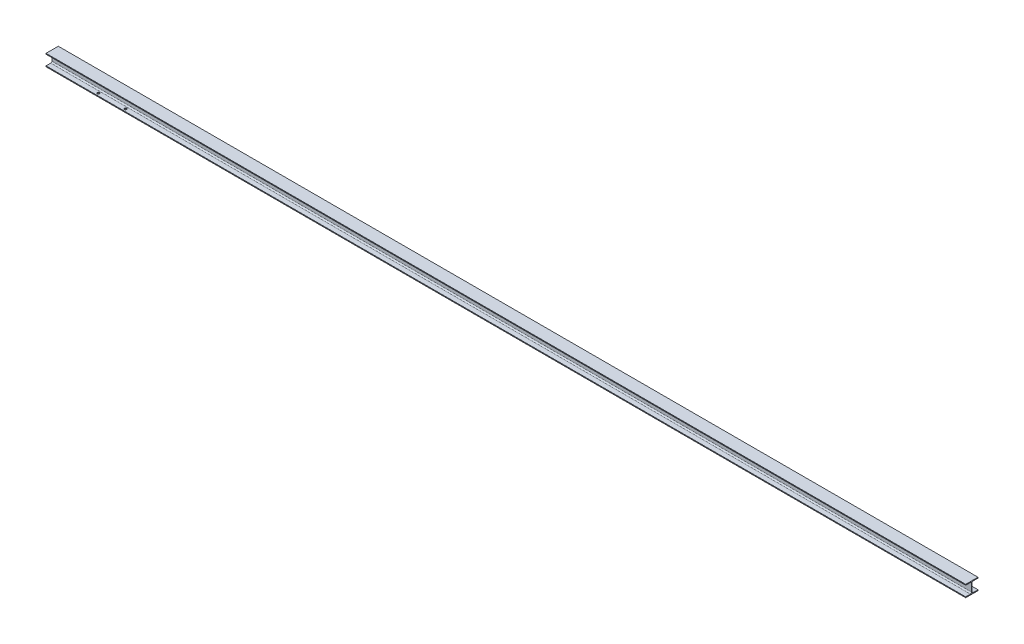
ISO-10303-21;
HEADER;
FILE_DESCRIPTION(('STEP AP214'),'2;1');
FILE_NAME('part.step','',(''),(''),'','','');
FILE_SCHEMA(('AUTOMOTIVE_DESIGN { 1 0 10303 214 1 1 1 1 }'));
ENDSEC;
DATA;
#1=APPLICATION_CONTEXT('core data for automotive mechanical design processes');
#2=APPLICATION_PROTOCOL_DEFINITION('international standard','automotive_design',2000,#1);
#3=PRODUCT_CONTEXT('',#1,'mechanical');
#4=PRODUCT('Part','Part','',(#3));
#5=PRODUCT_RELATED_PRODUCT_CATEGORY('part','',(#4));
#6=PRODUCT_DEFINITION_FORMATION('','',#4);
#7=PRODUCT_DEFINITION_CONTEXT('part definition',#1,'design');
#8=PRODUCT_DEFINITION('design','',#6,#7);
#9=PRODUCT_DEFINITION_SHAPE('','',#8);
#10=(LENGTH_UNIT() NAMED_UNIT(*) SI_UNIT(.MILLI.,.METRE.));
#11=(NAMED_UNIT(*) PLANE_ANGLE_UNIT() SI_UNIT($,.RADIAN.));
#12=(NAMED_UNIT(*) SI_UNIT($,.STERADIAN.) SOLID_ANGLE_UNIT());
#13=UNCERTAINTY_MEASURE_WITH_UNIT(LENGTH_MEASURE(1.E-05),#10,'distance_accuracy_value','');
#14=(GEOMETRIC_REPRESENTATION_CONTEXT(3) GLOBAL_UNCERTAINTY_ASSIGNED_CONTEXT((#13)) GLOBAL_UNIT_ASSIGNED_CONTEXT((#10,
#11,#12)) REPRESENTATION_CONTEXT('',''));
#15=CARTESIAN_POINT('',(0.,0.,0.));
#16=DIRECTION('',(0.,0.,1.));
#17=DIRECTION('',(1.,0.,0.));
#18=AXIS2_PLACEMENT_3D('',#15,#16,#17);
#19=CARTESIAN_POINT('',(9149.96897120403,37.0000000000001,-14.4999999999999));
#20=DIRECTION('',(-1.,0.,0.));
#21=DIRECTION('',(0.,-1.,0.));
#22=AXIS2_PLACEMENT_3D('',#19,#20,#21);
#23=PLANE('',#22);
#24=DIRECTION('',(0.,-1.,0.));
#25=VECTOR('',#24,1.);
#26=CARTESIAN_POINT('',(9149.96897120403,48.9999999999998,60.0000000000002));
#27=LINE('',#26,#25);
#28=CARTESIAN_POINT('',(9149.96897120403,56.9999999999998,60.0000000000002));
#29=VERTEX_POINT('',#28);
#30=CARTESIAN_POINT('',(9149.96897120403,48.9999999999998,60.0000000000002));
#31=VERTEX_POINT('',#30);
#32=EDGE_CURVE('E146',#29,#31,#27,.T.);
#33=ORIENTED_EDGE('',*,*,#32,.T.);
#34=DIRECTION('',(0.,0.,-1.));
#35=VECTOR('',#34,1.);
#36=CARTESIAN_POINT('',(9149.96897120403,49.,14.5000000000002));
#37=LINE('',#36,#35);
#38=CARTESIAN_POINT('',(9149.96897120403,49.,14.5000000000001));
#39=VERTEX_POINT('',#38);
#40=EDGE_CURVE('E142',#31,#39,#37,.T.);
#41=ORIENTED_EDGE('',*,*,#40,.T.);
#42=CARTESIAN_POINT('',(9149.96897120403,37.,14.5000000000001));
#43=DIRECTION('',(-1.,0.,0.));
#44=DIRECTION('',(0.,1.,0.));
#45=AXIS2_PLACEMENT_3D('',#42,#43,#44);
#46=CIRCLE('',#45,12.);
#47=CARTESIAN_POINT('',(9149.96897120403,37.,2.50000000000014));
#48=VERTEX_POINT('',#47);
#49=EDGE_CURVE('E160',#39,#48,#46,.T.);
#50=ORIENTED_EDGE('',*,*,#49,.T.);
#51=DIRECTION('',(0.,-1.,0.));
#52=VECTOR('',#51,1.);
#53=CARTESIAN_POINT('',(9149.96897120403,-37.,2.49999999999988));
#54=LINE('',#53,#52);
#55=CARTESIAN_POINT('',(9149.96897120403,-37.,2.49999999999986));
#56=VERTEX_POINT('',#55);
#57=EDGE_CURVE('E281',#48,#56,#54,.T.);
#58=ORIENTED_EDGE('',*,*,#57,.T.);
#59=CARTESIAN_POINT('',(9149.96897120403,-37.,14.4999999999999));
#60=DIRECTION('',(-1.,0.,0.));
#61=DIRECTION('',(0.,-1.,0.));
#62=AXIS2_PLACEMENT_3D('',#59,#60,#61);
#63=CIRCLE('',#62,12.);
#64=CARTESIAN_POINT('',(9149.96897120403,-49.,14.4999999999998));
#65=VERTEX_POINT('',#64);
#66=EDGE_CURVE('E279',#56,#65,#63,.T.);
#67=ORIENTED_EDGE('',*,*,#66,.T.);
#68=DIRECTION('',(0.,0.,1.));
#69=VECTOR('',#68,1.);
#70=CARTESIAN_POINT('',(9149.96897120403,-49.,14.4999999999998));
#71=LINE('',#70,#69);
#72=CARTESIAN_POINT('',(9149.96897120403,-49.0000000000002,59.9999999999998));
#73=VERTEX_POINT('',#72);
#74=EDGE_CURVE('E277',#65,#73,#71,.T.);
#75=ORIENTED_EDGE('',*,*,#74,.T.);
#76=DIRECTION('',(0.,-1.,0.));
#77=VECTOR('',#76,1.);
#78=CARTESIAN_POINT('',(9149.96897120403,-57.0000000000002,59.9999999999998));
#79=LINE('',#78,#77);
#80=CARTESIAN_POINT('',(9149.96897120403,-57.0000000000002,59.9999999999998));
#81=VERTEX_POINT('',#80);
#82=EDGE_CURVE('E275',#73,#81,#79,.T.);
#83=ORIENTED_EDGE('',*,*,#82,.T.);
#84=DIRECTION('',(0.,0.,-1.));
#85=VECTOR('',#84,1.);
#86=CARTESIAN_POINT('',(9149.96897120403,-56.9999999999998,-60.0000000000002));
#87=LINE('',#86,#85);
#88=CARTESIAN_POINT('',(9149.96897120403,-56.9999999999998,-60.0000000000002));
#89=VERTEX_POINT('',#88);
#90=EDGE_CURVE('E273',#81,#89,#87,.T.);
#91=ORIENTED_EDGE('',*,*,#90,.T.);
#92=DIRECTION('',(0.,1.,0.));
#93=VECTOR('',#92,1.);
#94=CARTESIAN_POINT('',(9149.96897120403,-56.9999999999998,-60.0000000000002));
#95=LINE('',#94,#93);
#96=CARTESIAN_POINT('',(9149.96897120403,-48.9999999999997,-60.0000000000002));
#97=VERTEX_POINT('',#96);
#98=EDGE_CURVE('E271',#89,#97,#95,.T.);
#99=ORIENTED_EDGE('',*,*,#98,.T.);
#100=DIRECTION('',(0.,0.,1.));
#101=VECTOR('',#100,1.);
#102=CARTESIAN_POINT('',(9149.96897120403,-48.9999999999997,-60.0000000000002));
#103=LINE('',#102,#101);
#104=CARTESIAN_POINT('',(9149.96897120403,-48.9999999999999,-14.5000000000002));
#105=VERTEX_POINT('',#104);
#106=EDGE_CURVE('E269',#97,#105,#103,.T.);
#107=ORIENTED_EDGE('',*,*,#106,.T.);
#108=CARTESIAN_POINT('',(9149.96897120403,-36.9999999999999,-14.5000000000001));
#109=DIRECTION('',(-1.,0.,0.));
#110=DIRECTION('',(0.,1.,0.));
#111=AXIS2_PLACEMENT_3D('',#108,#109,#110);
#112=CIRCLE('',#111,12.);
#113=CARTESIAN_POINT('',(9149.96897120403,-36.9999999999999,-2.50000000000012));
#114=VERTEX_POINT('',#113);
#115=EDGE_CURVE('E267',#105,#114,#112,.T.);
#116=ORIENTED_EDGE('',*,*,#115,.T.);
#117=DIRECTION('',(0.,1.,0.));
#118=VECTOR('',#117,1.);
#119=CARTESIAN_POINT('',(9149.96897120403,-36.9999999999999,-2.50000000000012));
#120=LINE('',#119,#118);
#121=CARTESIAN_POINT('',(9149.96897120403,37.0000000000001,-2.49999999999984));
#122=VERTEX_POINT('',#121);
#123=EDGE_CURVE('E265',#114,#122,#120,.T.);
#124=ORIENTED_EDGE('',*,*,#123,.T.);
#125=CARTESIAN_POINT('',(9149.96897120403,37.0000000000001,-14.4999999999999));
#126=DIRECTION('',(-1.,0.,0.));
#127=DIRECTION('',(0.,-1.,0.));
#128=AXIS2_PLACEMENT_3D('',#125,#126,#127);
#129=CIRCLE('',#128,12.);
#130=CARTESIAN_POINT('',(9149.96897120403,49.0000000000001,-14.4999999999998));
#131=VERTEX_POINT('',#130);
#132=EDGE_CURVE('E263',#122,#131,#129,.T.);
#133=ORIENTED_EDGE('',*,*,#132,.T.);
#134=DIRECTION('',(0.,0.,-1.));
#135=VECTOR('',#134,1.);
#136=CARTESIAN_POINT('',(9149.96897120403,49.0000000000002,-59.9999999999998));
#137=LINE('',#136,#135);
#138=CARTESIAN_POINT('',(9149.96897120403,49.0000000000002,-59.9999999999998));
#139=VERTEX_POINT('',#138);
#140=EDGE_CURVE('E261',#131,#139,#137,.T.);
#141=ORIENTED_EDGE('',*,*,#140,.T.);
#142=DIRECTION('',(0.,1.,0.));
#143=VECTOR('',#142,1.);
#144=CARTESIAN_POINT('',(9149.96897120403,49.0000000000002,-59.9999999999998));
#145=LINE('',#144,#143);
#146=CARTESIAN_POINT('',(9149.96897120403,57.0000000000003,-59.9999999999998));
#147=VERTEX_POINT('',#146);
#148=EDGE_CURVE('E259',#139,#147,#145,.T.);
#149=ORIENTED_EDGE('',*,*,#148,.T.);
#150=DIRECTION('',(0.,0.,1.));
#151=VECTOR('',#150,1.);
#152=CARTESIAN_POINT('',(9149.96897120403,57.0000000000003,-59.9999999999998));
#153=LINE('',#152,#151);
#154=EDGE_CURVE('E147',#147,#29,#153,.T.);
#155=ORIENTED_EDGE('',*,*,#154,.T.);
#156=EDGE_LOOP('',(#33,#41,#50,#58,#67,#75,#83,#91,#99,#107,#116,#124,#133,#141,#149,#155));
#157=FACE_BOUND('',#156,.T.);
#158=ADVANCED_FACE('F34',(#157),#23,.F.);
#159=CARTESIAN_POINT('',(169.999999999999,1900.,-147.000000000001));
#160=DIRECTION('',(-1.,0.,0.));
#161=DIRECTION('',(0.,0.,1.));
#162=AXIS2_PLACEMENT_3D('',#159,#160,#161);
#163=PLANE('',#162);
#164=DIRECTION('',(0.,1.,0.));
#165=VECTOR('',#164,1.);
#166=CARTESIAN_POINT('',(170.,48.9999999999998,60.0000000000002));
#167=LINE('',#166,#165);
#168=CARTESIAN_POINT('',(170.,48.9999999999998,60.0000000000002));
#169=VERTEX_POINT('',#168);
#170=CARTESIAN_POINT('',(170.,56.9999999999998,60.0000000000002));
#171=VERTEX_POINT('',#170);
#172=EDGE_CURVE('E165',#169,#171,#167,.T.);
#173=ORIENTED_EDGE('',*,*,#172,.T.);
#174=DIRECTION('',(0.,0.,-1.));
#175=VECTOR('',#174,1.);
#176=CARTESIAN_POINT('',(170.,57.0000000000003,-59.9999999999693));
#177=LINE('',#176,#175);
#178=CARTESIAN_POINT('',(170.,57.0000000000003,-59.9999999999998));
#179=VERTEX_POINT('',#178);
#180=EDGE_CURVE('E219',#171,#179,#177,.T.);
#181=ORIENTED_EDGE('',*,*,#180,.T.);
#182=DIRECTION('',(0.,-1.,0.));
#183=VECTOR('',#182,1.);
#184=CARTESIAN_POINT('',(170.,49.0000000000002,-59.9999999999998));
#185=LINE('',#184,#183);
#186=CARTESIAN_POINT('',(170.,49.0000000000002,-59.9999999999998));
#187=VERTEX_POINT('',#186);
#188=EDGE_CURVE('E215',#179,#187,#185,.T.);
#189=ORIENTED_EDGE('',*,*,#188,.T.);
#190=DIRECTION('',(0.,0.,1.));
#191=VECTOR('',#190,1.);
#192=CARTESIAN_POINT('',(170.,49.0000000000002,-59.9999999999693));
#193=LINE('',#192,#191);
#194=CARTESIAN_POINT('',(170.,49.0000000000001,-14.4999999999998));
#195=VERTEX_POINT('',#194);
#196=EDGE_CURVE('E218',#187,#195,#193,.T.);
#197=ORIENTED_EDGE('',*,*,#196,.T.);
#198=CARTESIAN_POINT('',(170.,37.0000000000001,-14.4999999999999));
#199=DIRECTION('',(-1.,0.,0.));
#200=DIRECTION('',(0.,0.,1.));
#201=AXIS2_PLACEMENT_3D('',#198,#199,#200);
#202=CIRCLE('',#201,12.);
#203=CARTESIAN_POINT('',(170.,37.0000000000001,-2.49999999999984));
#204=VERTEX_POINT('',#203);
#205=EDGE_CURVE('E222',#195,#204,#202,.F.);
#206=ORIENTED_EDGE('',*,*,#205,.T.);
#207=DIRECTION('',(0.,-1.,0.));
#208=VECTOR('',#207,1.);
#209=CARTESIAN_POINT('',(170.,-36.9999999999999,-2.50000000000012));
#210=LINE('',#209,#208);
#211=CARTESIAN_POINT('',(170.,-36.9999999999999,-2.50000000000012));
#212=VERTEX_POINT('',#211);
#213=EDGE_CURVE('E225',#204,#212,#210,.T.);
#214=ORIENTED_EDGE('',*,*,#213,.T.);
#215=CARTESIAN_POINT('',(170.,-36.9999999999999,-14.5000000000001));
#216=DIRECTION('',(-1.,0.,0.));
#217=DIRECTION('',(0.,0.,1.));
#218=AXIS2_PLACEMENT_3D('',#215,#216,#217);
#219=CIRCLE('',#218,12.);
#220=CARTESIAN_POINT('',(170.,-48.9999999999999,-14.5000000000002));
#221=VERTEX_POINT('',#220);
#222=EDGE_CURVE('E228',#212,#221,#219,.F.);
#223=ORIENTED_EDGE('',*,*,#222,.T.);
#224=DIRECTION('',(0.,0.,-1.));
#225=VECTOR('',#224,1.);
#226=CARTESIAN_POINT('',(170.,-48.9999999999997,-59.9999999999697));
#227=LINE('',#226,#225);
#228=CARTESIAN_POINT('',(170.,-48.9999999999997,-60.0000000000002));
#229=VERTEX_POINT('',#228);
#230=EDGE_CURVE('E231',#221,#229,#227,.T.);
#231=ORIENTED_EDGE('',*,*,#230,.T.);
#232=DIRECTION('',(0.,-1.,0.));
#233=VECTOR('',#232,1.);
#234=CARTESIAN_POINT('',(170.,-56.9999999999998,-60.0000000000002));
#235=LINE('',#234,#233);
#236=CARTESIAN_POINT('',(170.,-56.9999999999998,-60.0000000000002));
#237=VERTEX_POINT('',#236);
#238=EDGE_CURVE('E234',#229,#237,#235,.T.);
#239=ORIENTED_EDGE('',*,*,#238,.T.);
#240=DIRECTION('',(0.,0.,1.));
#241=VECTOR('',#240,1.);
#242=CARTESIAN_POINT('',(170.,-56.9999999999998,-59.9999999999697));
#243=LINE('',#242,#241);
#244=CARTESIAN_POINT('',(170.,-57.0000000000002,59.9999999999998));
#245=VERTEX_POINT('',#244);
#246=EDGE_CURVE('E237',#237,#245,#243,.T.);
#247=ORIENTED_EDGE('',*,*,#246,.T.);
#248=DIRECTION('',(0.,1.,0.));
#249=VECTOR('',#248,1.);
#250=CARTESIAN_POINT('',(170.,-57.0000000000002,59.9999999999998));
#251=LINE('',#250,#249);
#252=CARTESIAN_POINT('',(170.,-49.0000000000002,59.9999999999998));
#253=VERTEX_POINT('',#252);
#254=EDGE_CURVE('E240',#245,#253,#251,.T.);
#255=ORIENTED_EDGE('',*,*,#254,.T.);
#256=DIRECTION('',(0.,0.,-1.));
#257=VECTOR('',#256,1.);
#258=CARTESIAN_POINT('',(170.,-49.,14.5000000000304));
#259=LINE('',#258,#257);
#260=CARTESIAN_POINT('',(170.,-49.,14.4999999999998));
#261=VERTEX_POINT('',#260);
#262=EDGE_CURVE('E243',#253,#261,#259,.T.);
#263=ORIENTED_EDGE('',*,*,#262,.T.);
#264=CARTESIAN_POINT('',(170.,-37.,14.4999999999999));
#265=DIRECTION('',(-1.,0.,0.));
#266=DIRECTION('',(0.,0.,1.));
#267=AXIS2_PLACEMENT_3D('',#264,#265,#266);
#268=CIRCLE('',#267,12.);
#269=CARTESIAN_POINT('',(170.,-37.,2.49999999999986));
#270=VERTEX_POINT('',#269);
#271=EDGE_CURVE('E246',#261,#270,#268,.F.);
#272=ORIENTED_EDGE('',*,*,#271,.T.);
#273=DIRECTION('',(0.,1.,0.));
#274=VECTOR('',#273,1.);
#275=CARTESIAN_POINT('',(170.,-37.,2.49999999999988));
#276=LINE('',#275,#274);
#277=CARTESIAN_POINT('',(170.,37.,2.50000000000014));
#278=VERTEX_POINT('',#277);
#279=EDGE_CURVE('E249',#270,#278,#276,.T.);
#280=ORIENTED_EDGE('',*,*,#279,.T.);
#281=CARTESIAN_POINT('',(170.,37.,14.5000000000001));
#282=DIRECTION('',(-1.,0.,0.));
#283=DIRECTION('',(0.,0.,1.));
#284=AXIS2_PLACEMENT_3D('',#281,#282,#283);
#285=CIRCLE('',#284,12.);
#286=CARTESIAN_POINT('',(170.,49.,14.5000000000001));
#287=VERTEX_POINT('',#286);
#288=EDGE_CURVE('E252',#278,#287,#285,.F.);
#289=ORIENTED_EDGE('',*,*,#288,.T.);
#290=DIRECTION('',(0.,0.,1.));
#291=VECTOR('',#290,1.);
#292=CARTESIAN_POINT('',(170.,49.,14.5000000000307));
#293=LINE('',#292,#291);
#294=EDGE_CURVE('E170',#287,#169,#293,.T.);
#295=ORIENTED_EDGE('',*,*,#294,.T.);
#296=EDGE_LOOP('',(#173,#181,#189,#197,#206,#214,#223,#231,#239,#247,#255,#263,#272,#280,#289,#295));
#297=FACE_BOUND('',#296,.T.);
#298=ADVANCED_FACE('F348',(#297),#163,.T.);
#299=CARTESIAN_POINT('',(9149.96897120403,48.9999999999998,60.0000000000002));
#300=DIRECTION('',(0.,0.,-1.));
#301=DIRECTION('',(0.,1.,0.));
#302=AXIS2_PLACEMENT_3D('',#299,#300,#301);
#303=PLANE('',#302);
#304=DIRECTION('',(-1.,0.,0.));
#305=VECTOR('',#304,1.);
#306=CARTESIAN_POINT('',(9149.96897120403,48.9999999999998,60.0000000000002));
#307=LINE('',#306,#305);
#308=EDGE_CURVE('E156',#31,#169,#307,.T.);
#309=ORIENTED_EDGE('',*,*,#308,.F.);
#310=ORIENTED_EDGE('',*,*,#32,.F.);
#311=DIRECTION('',(-1.,0.,0.));
#312=VECTOR('',#311,1.);
#313=CARTESIAN_POINT('',(9149.96897120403,56.9999999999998,60.0000000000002));
#314=LINE('',#313,#312);
#315=EDGE_CURVE('E166',#29,#171,#314,.T.);
#316=ORIENTED_EDGE('',*,*,#315,.T.);
#317=ORIENTED_EDGE('',*,*,#172,.F.);
#318=EDGE_LOOP('',(#309,#310,#316,#317));
#319=FACE_BOUND('',#318,.T.);
#320=ADVANCED_FACE('F163',(#319),#303,.F.);
#321=CARTESIAN_POINT('',(9149.96897120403,49.,14.5000000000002));
#322=DIRECTION('',(0.,1.,0.));
#323=DIRECTION('',(0.,0.,1.));
#324=AXIS2_PLACEMENT_3D('',#321,#322,#323);
#325=PLANE('',#324);
#326=DIRECTION('',(-1.,0.,0.));
#327=VECTOR('',#326,1.);
#328=CARTESIAN_POINT('',(9149.96897120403,49.,14.5000000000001));
#329=LINE('',#328,#327);
#330=EDGE_CURVE('E158',#39,#287,#329,.T.);
#331=ORIENTED_EDGE('',*,*,#330,.F.);
#332=ORIENTED_EDGE('',*,*,#40,.F.);
#333=ORIENTED_EDGE('',*,*,#308,.T.);
#334=ORIENTED_EDGE('',*,*,#294,.F.);
#335=EDGE_LOOP('',(#331,#332,#333,#334));
#336=FACE_BOUND('',#335,.T.);
#337=ADVANCED_FACE('F154',(#336),#325,.F.);
#338=CARTESIAN_POINT('',(9149.96897120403,37.,14.5000000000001));
#339=DIRECTION('',(-1.,0.,0.));
#340=DIRECTION('',(0.,0.,1.));
#341=AXIS2_PLACEMENT_3D('',#338,#339,#340);
#342=CYLINDRICAL_SURFACE('',#341,12.);
#343=DIRECTION('',(-1.,0.,0.));
#344=VECTOR('',#343,1.);
#345=CARTESIAN_POINT('',(9149.96897120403,37.,2.50000000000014));
#346=LINE('',#345,#344);
#347=EDGE_CURVE('E168',#48,#278,#346,.T.);
#348=ORIENTED_EDGE('',*,*,#347,.F.);
#349=ORIENTED_EDGE('',*,*,#49,.F.);
#350=ORIENTED_EDGE('',*,*,#330,.T.);
#351=ORIENTED_EDGE('',*,*,#288,.F.);
#352=EDGE_LOOP('',(#348,#349,#350,#351));
#353=FACE_BOUND('',#352,.T.);
#354=ADVANCED_FACE('F288',(#353),#342,.F.);
#355=CARTESIAN_POINT('',(9149.96897120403,-37.,2.49999999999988));
#356=DIRECTION('',(0.,0.,-1.));
#357=DIRECTION('',(0.,1.,0.));
#358=AXIS2_PLACEMENT_3D('',#355,#356,#357);
#359=PLANE('',#358);
#360=DIRECTION('',(-1.,0.,0.));
#361=VECTOR('',#360,1.);
#362=CARTESIAN_POINT('',(9149.96897120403,-37.,2.49999999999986));
#363=LINE('',#362,#361);
#364=EDGE_CURVE('E174',#56,#270,#363,.T.);
#365=ORIENTED_EDGE('',*,*,#364,.F.);
#366=ORIENTED_EDGE('',*,*,#57,.F.);
#367=ORIENTED_EDGE('',*,*,#347,.T.);
#368=ORIENTED_EDGE('',*,*,#279,.F.);
#369=EDGE_LOOP('',(#365,#366,#367,#368));
#370=FACE_BOUND('',#369,.T.);
#371=ADVANCED_FACE('F291',(#370),#359,.F.);
#372=CARTESIAN_POINT('',(9149.96897120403,-37.,14.4999999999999));
#373=DIRECTION('',(-1.,0.,0.));
#374=DIRECTION('',(0.,0.,1.));
#375=AXIS2_PLACEMENT_3D('',#372,#373,#374);
#376=CYLINDRICAL_SURFACE('',#375,12.);
#377=DIRECTION('',(-1.,0.,0.));
#378=VECTOR('',#377,1.);
#379=CARTESIAN_POINT('',(9149.96897120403,-49.,14.4999999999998));
#380=LINE('',#379,#378);
#381=EDGE_CURVE('E176',#65,#261,#380,.T.);
#382=ORIENTED_EDGE('',*,*,#381,.F.);
#383=ORIENTED_EDGE('',*,*,#66,.F.);
#384=ORIENTED_EDGE('',*,*,#364,.T.);
#385=ORIENTED_EDGE('',*,*,#271,.F.);
#386=EDGE_LOOP('',(#382,#383,#384,#385));
#387=FACE_BOUND('',#386,.T.);
#388=ADVANCED_FACE('F296',(#387),#376,.F.);
#389=CARTESIAN_POINT('',(9149.96897120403,-49.,14.4999999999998));
#390=DIRECTION('',(0.,-1.,0.));
#391=DIRECTION('',(0.,0.,-1.));
#392=AXIS2_PLACEMENT_3D('',#389,#390,#391);
#393=PLANE('',#392);
#394=CARTESIAN_POINT('',(922.786796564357,-49.0000000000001,34.9999999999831));
#395=DIRECTION('',(0.,-1.,0.));
#396=DIRECTION('',(0.,0.,-1.));
#397=AXIS2_PLACEMENT_3D('',#394,#395,#396);
#398=CIRCLE('',#397,11.);
#399=CARTESIAN_POINT('',(922.786796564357,-49.,23.9999999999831));
#400=VERTEX_POINT('',#399);
#401=EDGE_CURVE('E151',#400,#400,#398,.T.);
#402=ORIENTED_EDGE('',*,*,#401,.T.);
#403=EDGE_LOOP('',(#402));
#404=FACE_BOUND('',#403,.T.);
#405=CARTESIAN_POINT('',(656.786796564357,-49.0000000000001,34.9999999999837));
#406=DIRECTION('',(0.,-1.,0.));
#407=DIRECTION('',(0.,0.,-1.));
#408=AXIS2_PLACEMENT_3D('',#405,#406,#407);
#409=CIRCLE('',#408,11.);
#410=CARTESIAN_POINT('',(656.786796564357,-49.,23.9999999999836));
#411=VERTEX_POINT('',#410);
#412=EDGE_CURVE('E200',#411,#411,#409,.T.);
#413=ORIENTED_EDGE('',*,*,#412,.T.);
#414=EDGE_LOOP('',(#413));
#415=FACE_BOUND('',#414,.T.);
#416=DIRECTION('',(-1.,0.,0.));
#417=VECTOR('',#416,1.);
#418=CARTESIAN_POINT('',(9149.96897120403,-49.0000000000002,59.9999999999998));
#419=LINE('',#418,#417);
#420=EDGE_CURVE('E178',#73,#253,#419,.T.);
#421=ORIENTED_EDGE('',*,*,#420,.F.);
#422=ORIENTED_EDGE('',*,*,#74,.F.);
#423=ORIENTED_EDGE('',*,*,#381,.T.);
#424=ORIENTED_EDGE('',*,*,#262,.F.);
#425=EDGE_LOOP('',(#421,#422,#423,#424));
#426=FACE_BOUND('',#425,.T.);
#427=ADVANCED_FACE('F303',(#404,#415,#426),#393,.F.);
#428=CARTESIAN_POINT('',(9149.96897120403,-57.0000000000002,59.9999999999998));
#429=DIRECTION('',(0.,0.,-1.));
#430=DIRECTION('',(0.,1.,0.));
#431=AXIS2_PLACEMENT_3D('',#428,#429,#430);
#432=PLANE('',#431);
#433=DIRECTION('',(-1.,0.,0.));
#434=VECTOR('',#433,1.);
#435=CARTESIAN_POINT('',(9149.96897120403,-57.0000000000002,59.9999999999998));
#436=LINE('',#435,#434);
#437=EDGE_CURVE('E180',#81,#245,#436,.T.);
#438=ORIENTED_EDGE('',*,*,#437,.F.);
#439=ORIENTED_EDGE('',*,*,#82,.F.);
#440=ORIENTED_EDGE('',*,*,#420,.T.);
#441=ORIENTED_EDGE('',*,*,#254,.F.);
#442=EDGE_LOOP('',(#438,#439,#440,#441));
#443=FACE_BOUND('',#442,.T.);
#444=ADVANCED_FACE('F306',(#443),#432,.F.);
#445=CARTESIAN_POINT('',(9149.96897120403,-56.9999999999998,-60.0000000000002));
#446=DIRECTION('',(0.,1.,0.));
#447=DIRECTION('',(0.,0.,1.));
#448=AXIS2_PLACEMENT_3D('',#445,#446,#447);
#449=PLANE('',#448);
#450=CARTESIAN_POINT('',(656.786796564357,-56.9999999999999,-35.0000000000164));
#451=DIRECTION('',(0.,-1.,0.));
#452=DIRECTION('',(0.,0.,-1.));
#453=AXIS2_PLACEMENT_3D('',#450,#451,#452);
#454=CIRCLE('',#453,11.);
#455=CARTESIAN_POINT('',(656.786796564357,-56.9999999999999,-46.0000000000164));
#456=VERTEX_POINT('',#455);
#457=EDGE_CURVE('E202',#456,#456,#454,.T.);
#458=ORIENTED_EDGE('',*,*,#457,.F.);
#459=EDGE_LOOP('',(#458));
#460=FACE_BOUND('',#459,.T.);
#461=CARTESIAN_POINT('',(922.786796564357,-57.0000000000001,34.9999999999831));
#462=DIRECTION('',(0.,-1.,0.));
#463=DIRECTION('',(0.,0.,-1.));
#464=AXIS2_PLACEMENT_3D('',#461,#462,#463);
#465=CIRCLE('',#464,11.);
#466=CARTESIAN_POINT('',(922.786796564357,-57.0000000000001,23.9999999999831));
#467=VERTEX_POINT('',#466);
#468=EDGE_CURVE('E207',#467,#467,#465,.T.);
#469=ORIENTED_EDGE('',*,*,#468,.F.);
#470=EDGE_LOOP('',(#469));
#471=FACE_BOUND('',#470,.T.);
#472=CARTESIAN_POINT('',(922.786796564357,-56.9999999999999,-35.0000000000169));
#473=DIRECTION('',(0.,-1.,0.));
#474=DIRECTION('',(0.,0.,-1.));
#475=AXIS2_PLACEMENT_3D('',#472,#473,#474);
#476=CIRCLE('',#475,11.);
#477=CARTESIAN_POINT('',(922.786796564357,-56.9999999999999,-46.0000000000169));
#478=VERTEX_POINT('',#477);
#479=EDGE_CURVE('E541',#478,#478,#476,.T.);
#480=ORIENTED_EDGE('',*,*,#479,.F.);
#481=EDGE_LOOP('',(#480));
#482=FACE_BOUND('',#481,.T.);
#483=CARTESIAN_POINT('',(656.786796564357,-57.0000000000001,34.9999999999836));
#484=DIRECTION('',(0.,-1.,0.));
#485=DIRECTION('',(0.,0.,-1.));
#486=AXIS2_PLACEMENT_3D('',#483,#484,#485);
#487=CIRCLE('',#486,11.);
#488=CARTESIAN_POINT('',(656.786796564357,-57.0000000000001,23.9999999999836));
#489=VERTEX_POINT('',#488);
#490=EDGE_CURVE('E196',#489,#489,#487,.T.);
#491=ORIENTED_EDGE('',*,*,#490,.F.);
#492=EDGE_LOOP('',(#491));
#493=FACE_BOUND('',#492,.T.);
#494=DIRECTION('',(-1.,0.,0.));
#495=VECTOR('',#494,1.);
#496=CARTESIAN_POINT('',(9149.96897120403,-56.9999999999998,-60.0000000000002));
#497=LINE('',#496,#495);
#498=EDGE_CURVE('E182',#89,#237,#497,.T.);
#499=ORIENTED_EDGE('',*,*,#498,.F.);
#500=ORIENTED_EDGE('',*,*,#90,.F.);
#501=ORIENTED_EDGE('',*,*,#437,.T.);
#502=ORIENTED_EDGE('',*,*,#246,.F.);
#503=EDGE_LOOP('',(#499,#500,#501,#502));
#504=FACE_BOUND('',#503,.T.);
#505=ADVANCED_FACE('F311',(#460,#471,#482,#493,#504),#449,.F.);
#506=CARTESIAN_POINT('',(9149.96897120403,-56.9999999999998,-60.0000000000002));
#507=DIRECTION('',(0.,0.,1.));
#508=DIRECTION('',(0.,-1.,0.));
#509=AXIS2_PLACEMENT_3D('',#506,#507,#508);
#510=PLANE('',#509);
#511=DIRECTION('',(-1.,0.,0.));
#512=VECTOR('',#511,1.);
#513=CARTESIAN_POINT('',(9149.96897120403,-48.9999999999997,-60.0000000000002));
#514=LINE('',#513,#512);
#515=EDGE_CURVE('E184',#97,#229,#514,.T.);
#516=ORIENTED_EDGE('',*,*,#515,.F.);
#517=ORIENTED_EDGE('',*,*,#98,.F.);
#518=ORIENTED_EDGE('',*,*,#498,.T.);
#519=ORIENTED_EDGE('',*,*,#238,.F.);
#520=EDGE_LOOP('',(#516,#517,#518,#519));
#521=FACE_BOUND('',#520,.T.);
#522=ADVANCED_FACE('F318',(#521),#510,.F.);
#523=CARTESIAN_POINT('',(9149.96897120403,-48.9999999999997,-60.0000000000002));
#524=DIRECTION('',(0.,-1.,0.));
#525=DIRECTION('',(0.,0.,-1.));
#526=AXIS2_PLACEMENT_3D('',#523,#524,#525);
#527=PLANE('',#526);
#528=CARTESIAN_POINT('',(656.786796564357,-48.9999999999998,-35.0000000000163));
#529=DIRECTION('',(0.,-1.,0.));
#530=DIRECTION('',(0.,0.,-1.));
#531=AXIS2_PLACEMENT_3D('',#528,#529,#530);
#532=CIRCLE('',#531,11.);
#533=CARTESIAN_POINT('',(656.786796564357,-48.9999999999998,-46.0000000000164));
#534=VERTEX_POINT('',#533);
#535=EDGE_CURVE('E37',#534,#534,#532,.T.);
#536=ORIENTED_EDGE('',*,*,#535,.T.);
#537=EDGE_LOOP('',(#536));
#538=FACE_BOUND('',#537,.T.);
#539=CARTESIAN_POINT('',(922.786796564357,-48.9999999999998,-35.0000000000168));
#540=DIRECTION('',(0.,-1.,0.));
#541=DIRECTION('',(0.,0.,-1.));
#542=AXIS2_PLACEMENT_3D('',#539,#540,#541);
#543=CIRCLE('',#542,11.);
#544=CARTESIAN_POINT('',(922.786796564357,-48.9999999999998,-46.0000000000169));
#545=VERTEX_POINT('',#544);
#546=EDGE_CURVE('E194',#545,#545,#543,.T.);
#547=ORIENTED_EDGE('',*,*,#546,.T.);
#548=EDGE_LOOP('',(#547));
#549=FACE_BOUND('',#548,.T.);
#550=DIRECTION('',(-1.,0.,0.));
#551=VECTOR('',#550,1.);
#552=CARTESIAN_POINT('',(9149.96897120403,-48.9999999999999,-14.5000000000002));
#553=LINE('',#552,#551);
#554=EDGE_CURVE('E186',#105,#221,#553,.T.);
#555=ORIENTED_EDGE('',*,*,#554,.F.);
#556=ORIENTED_EDGE('',*,*,#106,.F.);
#557=ORIENTED_EDGE('',*,*,#515,.T.);
#558=ORIENTED_EDGE('',*,*,#230,.F.);
#559=EDGE_LOOP('',(#555,#556,#557,#558));
#560=FACE_BOUND('',#559,.T.);
#561=ADVANCED_FACE('F321',(#538,#549,#560),#527,.F.);
#562=CARTESIAN_POINT('',(9149.96897120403,-36.9999999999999,-14.5000000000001));
#563=DIRECTION('',(-1.,0.,0.));
#564=DIRECTION('',(0.,0.,1.));
#565=AXIS2_PLACEMENT_3D('',#562,#563,#564);
#566=CYLINDRICAL_SURFACE('',#565,12.);
#567=DIRECTION('',(-1.,0.,0.));
#568=VECTOR('',#567,1.);
#569=CARTESIAN_POINT('',(9149.96897120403,-36.9999999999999,-2.50000000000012));
#570=LINE('',#569,#568);
#571=EDGE_CURVE('E188',#114,#212,#570,.T.);
#572=ORIENTED_EDGE('',*,*,#571,.F.);
#573=ORIENTED_EDGE('',*,*,#115,.F.);
#574=ORIENTED_EDGE('',*,*,#554,.T.);
#575=ORIENTED_EDGE('',*,*,#222,.F.);
#576=EDGE_LOOP('',(#572,#573,#574,#575));
#577=FACE_BOUND('',#576,.T.);
#578=ADVANCED_FACE('F326',(#577),#566,.F.);
#579=CARTESIAN_POINT('',(9149.96897120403,-36.9999999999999,-2.50000000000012));
#580=DIRECTION('',(0.,0.,1.));
#581=DIRECTION('',(0.,-1.,0.));
#582=AXIS2_PLACEMENT_3D('',#579,#580,#581);
#583=PLANE('',#582);
#584=DIRECTION('',(-1.,0.,0.));
#585=VECTOR('',#584,1.);
#586=CARTESIAN_POINT('',(9149.96897120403,37.0000000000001,-2.49999999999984));
#587=LINE('',#586,#585);
#588=EDGE_CURVE('E190',#122,#204,#587,.T.);
#589=ORIENTED_EDGE('',*,*,#588,.F.);
#590=ORIENTED_EDGE('',*,*,#123,.F.);
#591=ORIENTED_EDGE('',*,*,#571,.T.);
#592=ORIENTED_EDGE('',*,*,#213,.F.);
#593=EDGE_LOOP('',(#589,#590,#591,#592));
#594=FACE_BOUND('',#593,.T.);
#595=ADVANCED_FACE('F333',(#594),#583,.F.);
#596=CARTESIAN_POINT('',(9149.96897120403,37.0000000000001,-14.4999999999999));
#597=DIRECTION('',(-1.,0.,0.));
#598=DIRECTION('',(0.,0.,1.));
#599=AXIS2_PLACEMENT_3D('',#596,#597,#598);
#600=CYLINDRICAL_SURFACE('',#599,12.);
#601=DIRECTION('',(-1.,0.,0.));
#602=VECTOR('',#601,1.);
#603=CARTESIAN_POINT('',(9149.96897120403,49.0000000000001,-14.4999999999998));
#604=LINE('',#603,#602);
#605=EDGE_CURVE('E192',#131,#195,#604,.T.);
#606=ORIENTED_EDGE('',*,*,#605,.F.);
#607=ORIENTED_EDGE('',*,*,#132,.F.);
#608=ORIENTED_EDGE('',*,*,#588,.T.);
#609=ORIENTED_EDGE('',*,*,#205,.F.);
#610=EDGE_LOOP('',(#606,#607,#608,#609));
#611=FACE_BOUND('',#610,.T.);
#612=ADVANCED_FACE('F336',(#611),#600,.F.);
#613=CARTESIAN_POINT('',(9149.96897120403,49.0000000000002,-59.9999999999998));
#614=DIRECTION('',(0.,1.,0.));
#615=DIRECTION('',(0.,0.,1.));
#616=AXIS2_PLACEMENT_3D('',#613,#614,#615);
#617=PLANE('',#616);
#618=DIRECTION('',(-1.,0.,0.));
#619=VECTOR('',#618,1.);
#620=CARTESIAN_POINT('',(9149.96897120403,49.0000000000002,-59.9999999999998));
#621=LINE('',#620,#619);
#622=EDGE_CURVE('E43',#139,#187,#621,.T.);
#623=ORIENTED_EDGE('',*,*,#622,.F.);
#624=ORIENTED_EDGE('',*,*,#140,.F.);
#625=ORIENTED_EDGE('',*,*,#605,.T.);
#626=ORIENTED_EDGE('',*,*,#196,.F.);
#627=EDGE_LOOP('',(#623,#624,#625,#626));
#628=FACE_BOUND('',#627,.T.);
#629=ADVANCED_FACE('F341',(#628),#617,.F.);
#630=CARTESIAN_POINT('',(9149.96897120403,49.0000000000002,-59.9999999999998));
#631=DIRECTION('',(0.,0.,1.));
#632=DIRECTION('',(0.,-1.,0.));
#633=AXIS2_PLACEMENT_3D('',#630,#631,#632);
#634=PLANE('',#633);
#635=DIRECTION('',(-1.,0.,0.));
#636=VECTOR('',#635,1.);
#637=CARTESIAN_POINT('',(9149.96897120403,57.0000000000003,-59.9999999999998));
#638=LINE('',#637,#636);
#639=EDGE_CURVE('E11',#147,#179,#638,.T.);
#640=ORIENTED_EDGE('',*,*,#639,.F.);
#641=ORIENTED_EDGE('',*,*,#148,.F.);
#642=ORIENTED_EDGE('',*,*,#622,.T.);
#643=ORIENTED_EDGE('',*,*,#188,.F.);
#644=EDGE_LOOP('',(#640,#641,#642,#643));
#645=FACE_BOUND('',#644,.T.);
#646=ADVANCED_FACE('F345',(#645),#634,.F.);
#647=CARTESIAN_POINT('',(9149.96897120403,57.0000000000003,-59.9999999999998));
#648=DIRECTION('',(0.,-1.,0.));
#649=DIRECTION('',(0.,0.,-1.));
#650=AXIS2_PLACEMENT_3D('',#647,#648,#649);
#651=PLANE('',#650);
#652=ORIENTED_EDGE('',*,*,#315,.F.);
#653=ORIENTED_EDGE('',*,*,#154,.F.);
#654=ORIENTED_EDGE('',*,*,#639,.T.);
#655=ORIENTED_EDGE('',*,*,#180,.F.);
#656=EDGE_LOOP('',(#652,#653,#654,#655));
#657=FACE_BOUND('',#656,.T.);
#658=ADVANCED_FACE('F346',(#657),#651,.F.);
#659=CARTESIAN_POINT('',(922.786796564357,-36.9999999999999,-35.0000000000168));
#660=DIRECTION('',(0.,-1.,0.));
#661=DIRECTION('',(0.,0.,-1.));
#662=AXIS2_PLACEMENT_3D('',#659,#660,#661);
#663=CYLINDRICAL_SURFACE('',#662,11.);
#664=ORIENTED_EDGE('',*,*,#479,.T.);
#665=EDGE_LOOP('',(#664));
#666=FACE_BOUND('',#665,.T.);
#667=ORIENTED_EDGE('',*,*,#546,.F.);
#668=EDGE_LOOP('',(#667));
#669=FACE_BOUND('',#668,.T.);
#670=ADVANCED_FACE('F361',(#666,#669),#663,.F.);
#671=CARTESIAN_POINT('',(656.786796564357,-36.9999999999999,-35.0000000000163));
#672=DIRECTION('',(0.,-1.,0.));
#673=DIRECTION('',(0.,0.,-1.));
#674=AXIS2_PLACEMENT_3D('',#671,#672,#673);
#675=CYLINDRICAL_SURFACE('',#674,11.);
#676=ORIENTED_EDGE('',*,*,#457,.T.);
#677=EDGE_LOOP('',(#676));
#678=FACE_BOUND('',#677,.T.);
#679=ORIENTED_EDGE('',*,*,#535,.F.);
#680=EDGE_LOOP('',(#679));
#681=FACE_BOUND('',#680,.T.);
#682=ADVANCED_FACE('F473',(#678,#681),#675,.F.);
#683=CARTESIAN_POINT('',(656.786796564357,-37.0000000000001,34.9999999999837));
#684=DIRECTION('',(0.,-1.,0.));
#685=DIRECTION('',(0.,0.,-1.));
#686=AXIS2_PLACEMENT_3D('',#683,#684,#685);
#687=CYLINDRICAL_SURFACE('',#686,11.);
#688=ORIENTED_EDGE('',*,*,#490,.T.);
#689=EDGE_LOOP('',(#688));
#690=FACE_BOUND('',#689,.T.);
#691=ORIENTED_EDGE('',*,*,#412,.F.);
#692=EDGE_LOOP('',(#691));
#693=FACE_BOUND('',#692,.T.);
#694=ADVANCED_FACE('F357',(#690,#693),#687,.F.);
#695=CARTESIAN_POINT('',(922.786796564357,-37.0000000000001,34.9999999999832));
#696=DIRECTION('',(0.,-1.,0.));
#697=DIRECTION('',(0.,0.,-1.));
#698=AXIS2_PLACEMENT_3D('',#695,#696,#697);
#699=CYLINDRICAL_SURFACE('',#698,11.);
#700=ORIENTED_EDGE('',*,*,#468,.T.);
#701=EDGE_LOOP('',(#700));
#702=FACE_BOUND('',#701,.T.);
#703=ORIENTED_EDGE('',*,*,#401,.F.);
#704=EDGE_LOOP('',(#703));
#705=FACE_BOUND('',#704,.T.);
#706=ADVANCED_FACE('F490',(#702,#705),#699,.F.);
#707=CLOSED_SHELL('',(#158,#298,#320,#337,#354,#371,#388,#427,#444,#505,#522,#561,#578,#595,
#612,#629,#646,#658,#670,#682,#694,#706));
#708=MANIFOLD_SOLID_BREP('B2',#707);
#709=ADVANCED_BREP_SHAPE_REPRESENTATION('',(#18,#708),#14);
#710=SHAPE_DEFINITION_REPRESENTATION(#9,#709);
ENDSEC;
END-ISO-10303-21;
